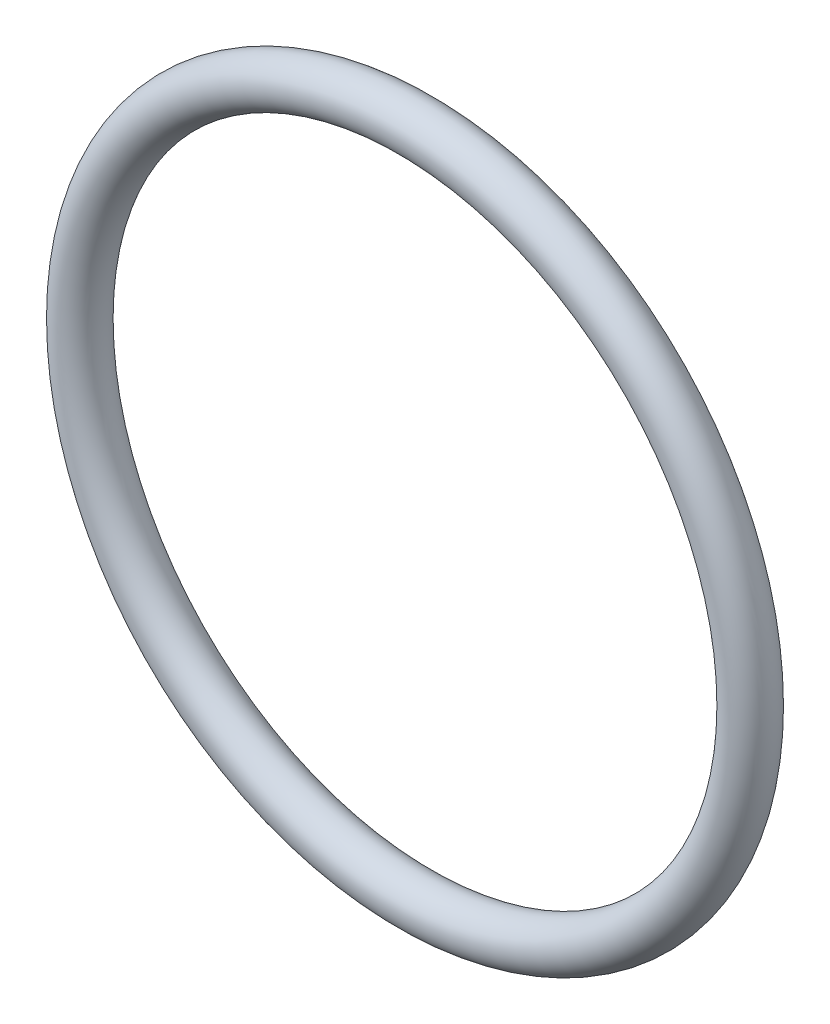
from build123d import *

# Parameters (mm, degrees)
SKETCH1_R = 0.889


with BuildPart() as part:
    # Sketch1 → Revolve1 (revolve)
    with BuildSketch(Plane(origin=(0, 0, 0), x_dir=(0, -1, 0), z_dir=(1, 0, 0)), mode=Mode.PRIVATE) as revolve1_sk:
        with Locations((12.6492, 0)):
            Circle(SKETCH1_R)
    revolve(revolve1_sk.sketch.rotate(Axis((0, 0, 0.889), (0, 0, -1)), 270), axis=Axis((0, 0, 0.889), (0, 0, -1)))


solid = part.part
